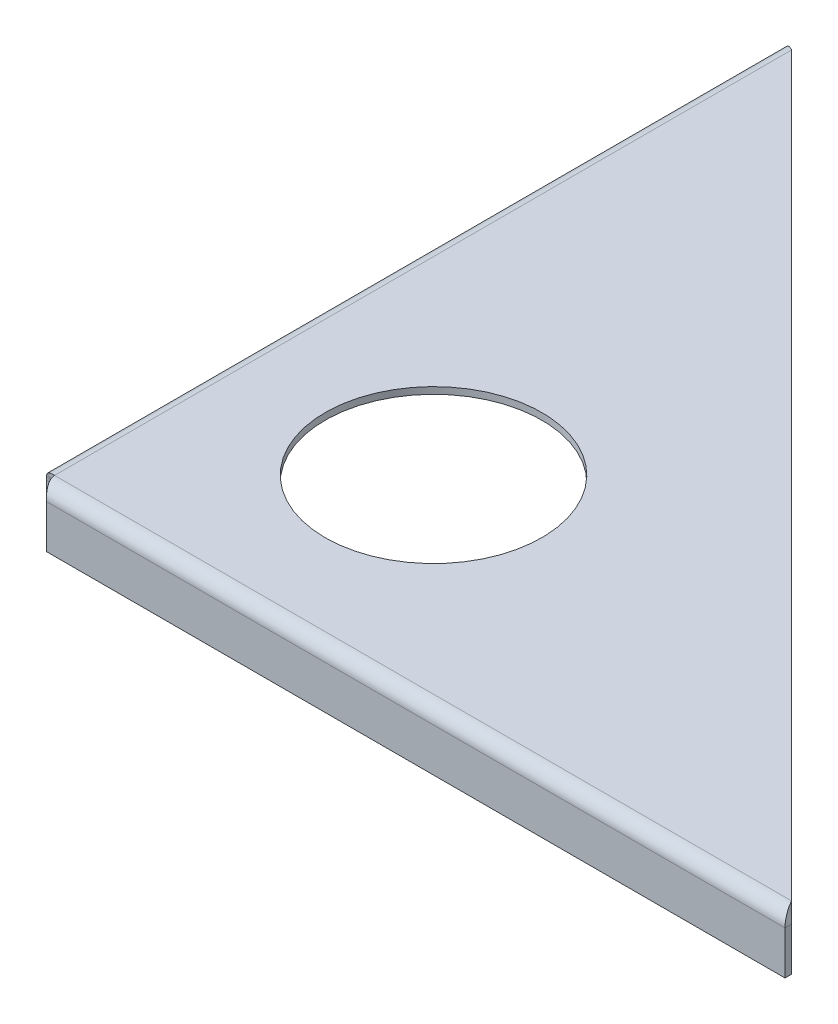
ISO-10303-21;
HEADER;
FILE_DESCRIPTION(('STEP AP214'),'2;1');
FILE_NAME('part.step','',(''),(''),'','','');
FILE_SCHEMA(('AUTOMOTIVE_DESIGN { 1 0 10303 214 1 1 1 1 }'));
ENDSEC;
DATA;
#1=APPLICATION_CONTEXT('core data for automotive mechanical design processes');
#2=APPLICATION_PROTOCOL_DEFINITION('international standard','automotive_design',2000,#1);
#3=PRODUCT_CONTEXT('',#1,'mechanical');
#4=PRODUCT('Part','Part','',(#3));
#5=PRODUCT_RELATED_PRODUCT_CATEGORY('part','',(#4));
#6=PRODUCT_DEFINITION_FORMATION('','',#4);
#7=PRODUCT_DEFINITION_CONTEXT('part definition',#1,'design');
#8=PRODUCT_DEFINITION('design','',#6,#7);
#9=PRODUCT_DEFINITION_SHAPE('','',#8);
#10=(LENGTH_UNIT() NAMED_UNIT(*) SI_UNIT(.MILLI.,.METRE.));
#11=(NAMED_UNIT(*) PLANE_ANGLE_UNIT() SI_UNIT($,.RADIAN.));
#12=(NAMED_UNIT(*) SI_UNIT($,.STERADIAN.) SOLID_ANGLE_UNIT());
#13=UNCERTAINTY_MEASURE_WITH_UNIT(LENGTH_MEASURE(1.E-05),#10,'distance_accuracy_value','');
#14=(GEOMETRIC_REPRESENTATION_CONTEXT(3) GLOBAL_UNCERTAINTY_ASSIGNED_CONTEXT((#13)) GLOBAL_UNIT_ASSIGNED_CONTEXT((#10,
#11,#12)) REPRESENTATION_CONTEXT('',''));
#15=CARTESIAN_POINT('',(0.,0.,0.));
#16=DIRECTION('',(0.,0.,1.));
#17=DIRECTION('',(1.,0.,0.));
#18=AXIS2_PLACEMENT_3D('',#15,#16,#17);
#19=CARTESIAN_POINT('',(1.4142135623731,-0.8,0.8));
#20=CARTESIAN_POINT('',(1.4142135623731,-0.585337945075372,0.8));
#21=CARTESIAN_POINT('',(1.37582521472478,-0.375007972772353,0.756592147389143));
#22=CARTESIAN_POINT('',(1.26066017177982,0.0102260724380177,0.595396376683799));
#23=CARTESIAN_POINT('',(1.18388347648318,0.185084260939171,0.477657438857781));
#24=CARTESIAN_POINT('',(1.03033008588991,0.477657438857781,0.185084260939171));
#25=CARTESIAN_POINT('',(0.953553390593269,0.595396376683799,0.0102260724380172));
#26=CARTESIAN_POINT('',(0.838388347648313,0.756592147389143,-0.375007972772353));
#27=CARTESIAN_POINT('',(0.799999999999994,0.8,-0.585337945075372));
#28=CARTESIAN_POINT('',(0.799999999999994,0.8,-0.8));
#29=CARTESIAN_POINT('',(1.4142135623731,-0.8,0.));
#30=CARTESIAN_POINT('',(1.4142135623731,-0.692668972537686,0.));
#31=CARTESIAN_POINT('',(1.37582521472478,-0.587503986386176,-0.0217039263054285));
#32=CARTESIAN_POINT('',(1.26066017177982,-0.394886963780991,-0.102301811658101));
#33=CARTESIAN_POINT('',(1.18388347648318,-0.307457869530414,-0.16117128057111));
#34=CARTESIAN_POINT('',(1.03033008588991,-0.16117128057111,-0.307457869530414));
#35=CARTESIAN_POINT('',(0.953553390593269,-0.102301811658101,-0.394886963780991));
#36=CARTESIAN_POINT('',(0.838388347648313,-0.0217039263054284,-0.587503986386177));
#37=CARTESIAN_POINT('',(0.799999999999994,0.,-0.692668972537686));
#38=CARTESIAN_POINT('',(0.799999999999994,0.,-0.8));
#39=B_SPLINE_SURFACE_WITH_KNOTS('',1,3,((#19,#20,#21,#22,#23,#24,#25,#26,#27,#28),(#29,#30,#31,
#32,#33,#34,#35,#36,#37,#38)),.UNSPECIFIED.,.F.,.F.,.F.,(2,2),(4,2,2,2,4),(0.,1.),(0.,0.25,0.5,
0.75,1.),.UNSPECIFIED.);
#40=CARTESIAN_POINT('',(0.8,0.,-0.799999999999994));
#41=CARTESIAN_POINT('',(0.8,0.8,-0.799999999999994));
#42=B_SPLINE_CURVE_WITH_KNOTS('',1,(#40,#41),.UNSPECIFIED.,.F.,.F.,(2,2),(0.,1.),.UNSPECIFIED.);
#43=CARTESIAN_POINT('',(0.799999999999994,0.,-0.799999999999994));
#44=VERTEX_POINT('',#43);
#45=CARTESIAN_POINT('',(0.799999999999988,0.8,-0.799999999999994));
#46=VERTEX_POINT('',#45);
#47=EDGE_CURVE('E11',#44,#46,#42,.T.);
#48=CARTESIAN_POINT('',(0.799999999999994,0.,-0.8));
#49=CARTESIAN_POINT('',(0.799999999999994,0.,-0.692668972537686));
#50=CARTESIAN_POINT('',(0.838388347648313,-0.0217039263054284,-0.587503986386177));
#51=CARTESIAN_POINT('',(0.953553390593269,-0.102301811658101,-0.394886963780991));
#52=CARTESIAN_POINT('',(1.03033008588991,-0.16117128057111,-0.307457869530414));
#53=CARTESIAN_POINT('',(1.18388347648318,-0.307457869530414,-0.16117128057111));
#54=CARTESIAN_POINT('',(1.26066017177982,-0.394886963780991,-0.102301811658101));
#55=CARTESIAN_POINT('',(1.37582521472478,-0.587503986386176,-0.0217039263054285));
#56=CARTESIAN_POINT('',(1.4142135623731,-0.692668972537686,0.));
#57=CARTESIAN_POINT('',(1.4142135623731,-0.8,0.));
#58=B_SPLINE_CURVE_WITH_KNOTS('',3,(#48,#49,#50,#51,#52,#53,#54,#55,#56,#57),.UNSPECIFIED.,.F.,
.F.,(4,2,2,2,4),(0.,0.25,0.5,0.75,1.),.UNSPECIFIED.);
#59=CARTESIAN_POINT('',(1.4142135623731,-0.8,0.));
#60=VERTEX_POINT('',#59);
#61=EDGE_CURVE('E147',#44,#60,#58,.T.);
#62=CARTESIAN_POINT('',(1.4142135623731,-0.8,0.));
#63=CARTESIAN_POINT('',(1.4142135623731,-0.8,0.8));
#64=B_SPLINE_CURVE_WITH_KNOTS('',1,(#62,#63),.UNSPECIFIED.,.F.,.F.,(2,2),(0.,1.),.UNSPECIFIED.);
#65=CARTESIAN_POINT('',(1.4142135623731,-0.800000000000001,0.8));
#66=VERTEX_POINT('',#65);
#67=EDGE_CURVE('E51',#60,#66,#64,.T.);
#68=CARTESIAN_POINT('',(1.4142135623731,-0.8,0.8));
#69=CARTESIAN_POINT('',(1.4142135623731,-0.585337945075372,0.8));
#70=CARTESIAN_POINT('',(1.37582521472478,-0.375007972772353,0.756592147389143));
#71=CARTESIAN_POINT('',(1.26066017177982,0.0102260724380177,0.595396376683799));
#72=CARTESIAN_POINT('',(1.18388347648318,0.185084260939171,0.477657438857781));
#73=CARTESIAN_POINT('',(1.03033008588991,0.477657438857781,0.185084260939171));
#74=CARTESIAN_POINT('',(0.953553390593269,0.595396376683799,0.0102260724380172));
#75=CARTESIAN_POINT('',(0.838388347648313,0.756592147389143,-0.375007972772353));
#76=CARTESIAN_POINT('',(0.799999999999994,0.8,-0.585337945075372));
#77=CARTESIAN_POINT('',(0.799999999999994,0.8,-0.8));
#78=B_SPLINE_CURVE_WITH_KNOTS('',3,(#68,#69,#70,#71,#72,#73,#74,#75,#76,#77),.UNSPECIFIED.,.F.,
.F.,(4,2,2,2,4),(0.,0.25,0.5,0.75,1.),.UNSPECIFIED.);
#79=EDGE_CURVE('E288',#46,#66,#78,.F.);
#80=ORIENTED_EDGE('',*,*,#47,.F.);
#81=ORIENTED_EDGE('',*,*,#61,.T.);
#82=ORIENTED_EDGE('',*,*,#67,.T.);
#83=ORIENTED_EDGE('',*,*,#79,.F.);
#84=EDGE_LOOP('',(#80,#81,#82,#83));
#85=FACE_BOUND('',#84,.T.);
#86=ADVANCED_FACE('F38',(#85),#39,.F.);
#87=CARTESIAN_POINT('',(1.4142135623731,-6.,0.));
#88=DIRECTION('',(-1.,0.,0.));
#89=DIRECTION('',(0.,-1.,0.));
#90=AXIS2_PLACEMENT_3D('',#87,#88,#89);
#91=PLANE('',#90);
#92=ORIENTED_EDGE('',*,*,#67,.F.);
#93=DIRECTION('',(0.,-1.,0.));
#94=VECTOR('',#93,1.);
#95=CARTESIAN_POINT('',(1.4142135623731,-6.,0.));
#96=LINE('',#95,#94);
#97=CARTESIAN_POINT('',(1.41421356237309,-6.,0.));
#98=VERTEX_POINT('',#97);
#99=EDGE_CURVE('E137',#60,#98,#96,.T.);
#100=ORIENTED_EDGE('',*,*,#99,.T.);
#101=DIRECTION('',(0.,0.,1.));
#102=VECTOR('',#101,1.);
#103=CARTESIAN_POINT('',(1.41421356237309,-6.,0.));
#104=LINE('',#103,#102);
#105=CARTESIAN_POINT('',(1.41421356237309,-6.,0.8));
#106=VERTEX_POINT('',#105);
#107=EDGE_CURVE('E657',#98,#106,#104,.T.);
#108=ORIENTED_EDGE('',*,*,#107,.T.);
#109=DIRECTION('',(0.,1.,0.));
#110=VECTOR('',#109,1.);
#111=CARTESIAN_POINT('',(1.4142135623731,-6.,0.8));
#112=LINE('',#111,#110);
#113=EDGE_CURVE('E177',#66,#106,#112,.F.);
#114=ORIENTED_EDGE('',*,*,#113,.F.);
#115=EDGE_LOOP('',(#92,#100,#108,#114));
#116=FACE_BOUND('',#115,.T.);
#117=ADVANCED_FACE('F302',(#116),#91,.T.);
#118=CARTESIAN_POINT('',(0.,-6.,0.));
#119=DIRECTION('',(0.,-1.,0.));
#120=DIRECTION('',(1.,0.,0.));
#121=AXIS2_PLACEMENT_3D('',#118,#119,#120);
#122=PLANE('',#121);
#123=ORIENTED_EDGE('',*,*,#107,.F.);
#124=DIRECTION('',(1.,0.,0.));
#125=VECTOR('',#124,1.);
#126=CARTESIAN_POINT('',(0.,-6.,0.));
#127=LINE('',#126,#125);
#128=CARTESIAN_POINT('',(90.,-6.,0.));
#129=VERTEX_POINT('',#128);
#130=EDGE_CURVE('E151',#98,#129,#127,.T.);
#131=ORIENTED_EDGE('',*,*,#130,.T.);
#132=DIRECTION('',(0.,0.,1.));
#133=VECTOR('',#132,1.);
#134=CARTESIAN_POINT('',(90.,-6.,0.));
#135=LINE('',#134,#133);
#136=CARTESIAN_POINT('',(90.,-6.,0.8));
#137=VERTEX_POINT('',#136);
#138=EDGE_CURVE('E126',#129,#137,#135,.T.);
#139=ORIENTED_EDGE('',*,*,#138,.T.);
#140=DIRECTION('',(1.,0.,0.));
#141=VECTOR('',#140,1.);
#142=CARTESIAN_POINT('',(0.,-6.,0.8));
#143=LINE('',#142,#141);
#144=EDGE_CURVE('E392',#106,#137,#143,.T.);
#145=ORIENTED_EDGE('',*,*,#144,.F.);
#146=EDGE_LOOP('',(#123,#131,#139,#145));
#147=FACE_BOUND('',#146,.T.);
#148=ADVANCED_FACE('F521',(#147),#122,.T.);
#149=CARTESIAN_POINT('',(90.,-6.,0.));
#150=DIRECTION('',(1.,0.,0.));
#151=DIRECTION('',(0.,1.,0.));
#152=AXIS2_PLACEMENT_3D('',#149,#150,#151);
#153=PLANE('',#152);
#154=ORIENTED_EDGE('',*,*,#138,.F.);
#155=DIRECTION('',(0.,1.,0.));
#156=VECTOR('',#155,1.);
#157=CARTESIAN_POINT('',(90.,-6.,0.));
#158=LINE('',#157,#156);
#159=CARTESIAN_POINT('',(90.,-0.8,0.));
#160=VERTEX_POINT('',#159);
#161=EDGE_CURVE('E135',#129,#160,#158,.T.);
#162=ORIENTED_EDGE('',*,*,#161,.T.);
#163=DIRECTION('',(0.,0.,1.));
#164=VECTOR('',#163,1.);
#165=CARTESIAN_POINT('',(90.,-0.8,0.));
#166=LINE('',#165,#164);
#167=CARTESIAN_POINT('',(90.,-0.8,0.8));
#168=VERTEX_POINT('',#167);
#169=EDGE_CURVE('E59',#160,#168,#166,.T.);
#170=ORIENTED_EDGE('',*,*,#169,.T.);
#171=DIRECTION('',(0.,1.,0.));
#172=VECTOR('',#171,1.);
#173=CARTESIAN_POINT('',(90.,-6.,0.8));
#174=LINE('',#173,#172);
#175=EDGE_CURVE('E395',#137,#168,#174,.T.);
#176=ORIENTED_EDGE('',*,*,#175,.F.);
#177=EDGE_LOOP('',(#154,#162,#170,#176));
#178=FACE_BOUND('',#177,.T.);
#179=ADVANCED_FACE('F149',(#178),#153,.T.);
#180=CARTESIAN_POINT('',(90.,-0.8,0.8));
#181=CARTESIAN_POINT('',(90.,-0.8,0.533333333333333));
#182=CARTESIAN_POINT('',(90.,-0.8,0.266666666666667));
#183=CARTESIAN_POINT('',(90.,-0.8,0.));
#184=CARTESIAN_POINT('',(90.,2.4,0.8));
#185=CARTESIAN_POINT('',(90.,1.86666666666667,0.533333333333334));
#186=CARTESIAN_POINT('',(90.,1.33333333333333,0.266666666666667));
#187=CARTESIAN_POINT('',(90.,0.8,0.));
#188=CARTESIAN_POINT('',(88.4,2.4,-2.4));
#189=CARTESIAN_POINT('',(88.4,1.86666666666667,-2.13333333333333));
#190=CARTESIAN_POINT('',(88.4,1.33333333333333,-1.86666666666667));
#191=CARTESIAN_POINT('',(88.4,0.8,-1.6));
#192=CARTESIAN_POINT('',(88.4,-0.8,-2.4));
#193=CARTESIAN_POINT('',(88.4,-0.8,-2.13333333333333));
#194=CARTESIAN_POINT('',(88.4,-0.8,-1.86666666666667));
#195=CARTESIAN_POINT('',(88.4,-0.8,-1.6));
#196=CARTESIAN_POINT('',(88.4,-4.,-2.4));
#197=CARTESIAN_POINT('',(88.4,-3.46666666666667,-2.13333333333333));
#198=CARTESIAN_POINT('',(88.4,-2.93333333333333,-1.86666666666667));
#199=CARTESIAN_POINT('',(88.4,-2.4,-1.6));
#200=CARTESIAN_POINT('',(90.,-4.,0.8));
#201=CARTESIAN_POINT('',(90.,-3.46666666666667,0.533333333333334));
#202=CARTESIAN_POINT('',(90.,-2.93333333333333,0.266666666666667));
#203=CARTESIAN_POINT('',(90.,-2.4,0.));
#204=CARTESIAN_POINT('',(90.,-0.8,0.8));
#205=CARTESIAN_POINT('',(90.,-0.8,0.533333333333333));
#206=CARTESIAN_POINT('',(90.,-0.8,0.266666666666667));
#207=CARTESIAN_POINT('',(90.,-0.8,0.));
#208=(BOUNDED_SURFACE() B_SPLINE_SURFACE(3,3,((#180,#181,#182,#183),(#184,#185,#186,#187),(#188,
#189,#190,#191),(#192,#193,#194,#195),(#196,#197,#198,#199),(#200,#201,#202,#203),(#204,#205,
#206,#207)),.UNSPECIFIED.,.T.,.F.,.F.) B_SPLINE_SURFACE_WITH_KNOTS((4,3,4),(4,4),(0.,0.5,1.),
(0.,1.),.UNSPECIFIED.) GEOMETRIC_REPRESENTATION_ITEM() RATIONAL_B_SPLINE_SURFACE(((1.,1.,1.,1.),
(0.333333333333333,0.333333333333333,0.333333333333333,0.333333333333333),(0.333333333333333,
0.333333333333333,0.333333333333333,0.333333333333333),(1.,1.,1.,1.),(0.333333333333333,
0.333333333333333,0.333333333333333,0.333333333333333),(0.333333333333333,0.333333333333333,
0.333333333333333,0.333333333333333),(1.,1.,1.,1.))) REPRESENTATION_ITEM('') SURFACE());
#209=CARTESIAN_POINT('',(89.2,-0.8,-0.8));
#210=DIRECTION('',(0.707106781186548,0.,-0.707106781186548));
#211=DIRECTION('',(0.707106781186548,0.,0.707106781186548));
#212=AXIS2_PLACEMENT_3D('',#209,#210,#211);
#213=ELLIPSE('',#212,1.13137084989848,0.8);
#214=CARTESIAN_POINT('',(89.2,0.,-0.799999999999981));
#215=VERTEX_POINT('',#214);
#216=EDGE_CURVE('E122',#160,#215,#213,.F.);
#217=DIRECTION('',(0.,1.,0.));
#218=VECTOR('',#217,1.);
#219=CARTESIAN_POINT('',(89.2,0.,-0.799999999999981));
#220=LINE('',#219,#218);
#221=CARTESIAN_POINT('',(89.2,0.8,-0.799999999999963));
#222=VERTEX_POINT('',#221);
#223=EDGE_CURVE('E127',#215,#222,#220,.T.);
#224=CARTESIAN_POINT('',(89.2,-0.8,-0.8));
#225=DIRECTION('',(0.894427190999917,0.,-0.447213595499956));
#226=DIRECTION('',(0.447213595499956,0.,0.894427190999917));
#227=AXIS2_PLACEMENT_3D('',#224,#225,#226);
#228=ELLIPSE('',#227,1.78885438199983,1.6);
#229=EDGE_CURVE('E124',#168,#222,#228,.F.);
#230=ORIENTED_EDGE('',*,*,#169,.F.);
#231=ORIENTED_EDGE('',*,*,#216,.T.);
#232=ORIENTED_EDGE('',*,*,#223,.T.);
#233=ORIENTED_EDGE('',*,*,#229,.F.);
#234=EDGE_LOOP('',(#230,#231,#232,#233));
#235=FACE_BOUND('',#234,.T.);
#236=ADVANCED_FACE('F119',(#235),#208,.F.);
#237=CARTESIAN_POINT('',(0.,0.,-90.));
#238=DIRECTION('',(0.707106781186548,0.,-0.707106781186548));
#239=DIRECTION('',(-0.707106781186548,0.,-0.707106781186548));
#240=AXIS2_PLACEMENT_3D('',#237,#238,#239);
#241=PLANE('',#240);
#242=ORIENTED_EDGE('',*,*,#223,.F.);
#243=DIRECTION('',(-0.707106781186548,0.,-0.707106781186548));
#244=VECTOR('',#243,1.);
#245=CARTESIAN_POINT('',(0.,0.,-90.));
#246=LINE('',#245,#244);
#247=CARTESIAN_POINT('',(0.799999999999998,0.,-89.2));
#248=VERTEX_POINT('',#247);
#249=EDGE_CURVE('E156',#215,#248,#246,.T.);
#250=ORIENTED_EDGE('',*,*,#249,.T.);
#251=DIRECTION('',(0.,1.,0.));
#252=VECTOR('',#251,1.);
#253=CARTESIAN_POINT('',(0.799999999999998,0.,-89.2));
#254=LINE('',#253,#252);
#255=CARTESIAN_POINT('',(0.799999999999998,0.8,-89.2));
#256=VERTEX_POINT('',#255);
#257=EDGE_CURVE('E388',#248,#256,#254,.T.);
#258=ORIENTED_EDGE('',*,*,#257,.T.);
#259=DIRECTION('',(-0.707106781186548,0.,-0.707106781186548));
#260=VECTOR('',#259,1.);
#261=CARTESIAN_POINT('',(0.,0.8,-90.));
#262=LINE('',#261,#260);
#263=EDGE_CURVE('E396',#222,#256,#262,.T.);
#264=ORIENTED_EDGE('',*,*,#263,.F.);
#265=EDGE_LOOP('',(#242,#250,#258,#264));
#266=FACE_BOUND('',#265,.T.);
#267=ADVANCED_FACE('F386',(#266),#241,.T.);
#268=CARTESIAN_POINT('',(1.6,-0.8,-88.4));
#269=CARTESIAN_POINT('',(1.86666666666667,-0.8,-88.4));
#270=CARTESIAN_POINT('',(2.13333333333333,-0.8,-88.4));
#271=CARTESIAN_POINT('',(2.4,-0.8,-88.4));
#272=CARTESIAN_POINT('',(1.6,0.8,-88.4));
#273=CARTESIAN_POINT('',(1.86666666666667,1.33333333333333,-88.4));
#274=CARTESIAN_POINT('',(2.13333333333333,1.86666666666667,-88.4));
#275=CARTESIAN_POINT('',(2.4,2.4,-88.4));
#276=CARTESIAN_POINT('',(0.,0.8,-90.));
#277=CARTESIAN_POINT('',(-0.266666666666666,1.33333333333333,-90.));
#278=CARTESIAN_POINT('',(-0.533333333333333,1.86666666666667,-90.));
#279=CARTESIAN_POINT('',(-0.8,2.4,-90.));
#280=CARTESIAN_POINT('',(0.,-0.8,-90.));
#281=CARTESIAN_POINT('',(-0.266666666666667,-0.8,-90.));
#282=CARTESIAN_POINT('',(-0.533333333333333,-0.8,-90.));
#283=CARTESIAN_POINT('',(-0.8,-0.8,-90.));
#284=CARTESIAN_POINT('',(0.,-2.4,-90.));
#285=CARTESIAN_POINT('',(-0.266666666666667,-2.93333333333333,-90.));
#286=CARTESIAN_POINT('',(-0.533333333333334,-3.46666666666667,-90.));
#287=CARTESIAN_POINT('',(-0.8,-4.,-90.));
#288=CARTESIAN_POINT('',(1.6,-2.4,-88.4));
#289=CARTESIAN_POINT('',(1.86666666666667,-2.93333333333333,-88.4));
#290=CARTESIAN_POINT('',(2.13333333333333,-3.46666666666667,-88.4));
#291=CARTESIAN_POINT('',(2.4,-4.,-88.4));
#292=CARTESIAN_POINT('',(1.6,-0.8,-88.4));
#293=CARTESIAN_POINT('',(1.86666666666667,-0.8,-88.4));
#294=CARTESIAN_POINT('',(2.13333333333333,-0.8,-88.4));
#295=CARTESIAN_POINT('',(2.4,-0.8,-88.4));
#296=(BOUNDED_SURFACE() B_SPLINE_SURFACE(3,3,((#268,#269,#270,#271),(#272,#273,#274,#275),(#276,
#277,#278,#279),(#280,#281,#282,#283),(#284,#285,#286,#287),(#288,#289,#290,#291),(#292,#293,
#294,#295)),.UNSPECIFIED.,.T.,.F.,.F.) B_SPLINE_SURFACE_WITH_KNOTS((4,3,4),(4,4),(0.,0.5,1.),
(0.,1.),.UNSPECIFIED.) GEOMETRIC_REPRESENTATION_ITEM() RATIONAL_B_SPLINE_SURFACE(((1.,1.,1.,1.),
(0.333333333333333,0.333333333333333,0.333333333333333,0.333333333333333),(0.333333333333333,
0.333333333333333,0.333333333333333,0.333333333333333),(1.,1.,1.,1.),(0.333333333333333,
0.333333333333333,0.333333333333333,0.333333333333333),(0.333333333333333,0.333333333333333,
0.333333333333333,0.333333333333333),(1.,1.,1.,1.))) REPRESENTATION_ITEM('') SURFACE());
#297=CARTESIAN_POINT('',(0.8,-0.8,-89.2));
#298=DIRECTION('',(-0.707106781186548,0.,0.707106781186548));
#299=DIRECTION('',(0.707106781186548,0.,0.707106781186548));
#300=AXIS2_PLACEMENT_3D('',#297,#298,#299);
#301=ELLIPSE('',#300,1.13137084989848,0.8);
#302=CARTESIAN_POINT('',(0.,-0.8,-90.));
#303=VERTEX_POINT('',#302);
#304=EDGE_CURVE('E163',#248,#303,#301,.T.);
#305=DIRECTION('',(-1.,0.,0.));
#306=VECTOR('',#305,1.);
#307=CARTESIAN_POINT('',(0.,-0.8,-90.));
#308=LINE('',#307,#306);
#309=CARTESIAN_POINT('',(-0.8,-0.800000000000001,-90.));
#310=VERTEX_POINT('',#309);
#311=EDGE_CURVE('E663',#303,#310,#308,.T.);
#312=CARTESIAN_POINT('',(0.8,-0.8,-89.2));
#313=DIRECTION('',(-0.447213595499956,0.,0.894427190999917));
#314=DIRECTION('',(0.894427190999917,0.,0.447213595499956));
#315=AXIS2_PLACEMENT_3D('',#312,#313,#314);
#316=ELLIPSE('',#315,1.78885438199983,1.6);
#317=EDGE_CURVE('E401',#256,#310,#316,.T.);
#318=ORIENTED_EDGE('',*,*,#257,.F.);
#319=ORIENTED_EDGE('',*,*,#304,.T.);
#320=ORIENTED_EDGE('',*,*,#311,.T.);
#321=ORIENTED_EDGE('',*,*,#317,.F.);
#322=EDGE_LOOP('',(#318,#319,#320,#321));
#323=FACE_BOUND('',#322,.T.);
#324=ADVANCED_FACE('F495',(#323),#296,.T.);
#325=CARTESIAN_POINT('',(0.,-6.,-90.));
#326=DIRECTION('',(0.,0.,1.));
#327=DIRECTION('',(0.,1.,0.));
#328=AXIS2_PLACEMENT_3D('',#325,#326,#327);
#329=PLANE('',#328);
#330=ORIENTED_EDGE('',*,*,#311,.F.);
#331=DIRECTION('',(0.,1.,0.));
#332=VECTOR('',#331,1.);
#333=CARTESIAN_POINT('',(0.,-6.,-90.));
#334=LINE('',#333,#332);
#335=CARTESIAN_POINT('',(0.,-6.,-90.));
#336=VERTEX_POINT('',#335);
#337=EDGE_CURVE('E150',#336,#303,#334,.T.);
#338=ORIENTED_EDGE('',*,*,#337,.F.);
#339=DIRECTION('',(-1.,0.,0.));
#340=VECTOR('',#339,1.);
#341=CARTESIAN_POINT('',(0.,-6.,-90.));
#342=LINE('',#341,#340);
#343=CARTESIAN_POINT('',(-0.8,-6.,-90.));
#344=VERTEX_POINT('',#343);
#345=EDGE_CURVE('E665',#336,#344,#342,.T.);
#346=ORIENTED_EDGE('',*,*,#345,.T.);
#347=DIRECTION('',(0.,1.,0.));
#348=VECTOR('',#347,1.);
#349=CARTESIAN_POINT('',(-0.8,-6.,-90.));
#350=LINE('',#349,#348);
#351=EDGE_CURVE('E398',#344,#310,#350,.T.);
#352=ORIENTED_EDGE('',*,*,#351,.T.);
#353=EDGE_LOOP('',(#330,#338,#346,#352));
#354=FACE_BOUND('',#353,.T.);
#355=ADVANCED_FACE('F488',(#354),#329,.F.);
#356=CARTESIAN_POINT('',(0.,-6.,0.));
#357=DIRECTION('',(0.,-1.,0.));
#358=DIRECTION('',(0.,0.,1.));
#359=AXIS2_PLACEMENT_3D('',#356,#357,#358);
#360=PLANE('',#359);
#361=ORIENTED_EDGE('',*,*,#345,.F.);
#362=DIRECTION('',(0.,0.,1.));
#363=VECTOR('',#362,1.);
#364=CARTESIAN_POINT('',(0.,-6.,0.));
#365=LINE('',#364,#363);
#366=CARTESIAN_POINT('',(0.,-6.,-1.41421356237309));
#367=VERTEX_POINT('',#366);
#368=EDGE_CURVE('E154',#336,#367,#365,.T.);
#369=ORIENTED_EDGE('',*,*,#368,.T.);
#370=DIRECTION('',(-1.,0.,0.));
#371=VECTOR('',#370,1.);
#372=CARTESIAN_POINT('',(0.,-6.,-1.41421356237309));
#373=LINE('',#372,#371);
#374=CARTESIAN_POINT('',(-0.8,-6.,-1.41421356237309));
#375=VERTEX_POINT('',#374);
#376=EDGE_CURVE('E373',#367,#375,#373,.T.);
#377=ORIENTED_EDGE('',*,*,#376,.T.);
#378=DIRECTION('',(0.,0.,1.));
#379=VECTOR('',#378,1.);
#380=CARTESIAN_POINT('',(-0.8,-6.,0.));
#381=LINE('',#380,#379);
#382=EDGE_CURVE('E229',#344,#375,#381,.T.);
#383=ORIENTED_EDGE('',*,*,#382,.F.);
#384=EDGE_LOOP('',(#361,#369,#377,#383));
#385=FACE_BOUND('',#384,.T.);
#386=ADVANCED_FACE('F482',(#385),#360,.T.);
#387=CARTESIAN_POINT('',(0.,-6.,-1.4142135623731));
#388=DIRECTION('',(0.,0.,1.));
#389=DIRECTION('',(0.,1.,0.));
#390=AXIS2_PLACEMENT_3D('',#387,#388,#389);
#391=PLANE('',#390);
#392=ORIENTED_EDGE('',*,*,#376,.F.);
#393=DIRECTION('',(0.,1.,0.));
#394=VECTOR('',#393,1.);
#395=CARTESIAN_POINT('',(0.,-6.,-1.4142135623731));
#396=LINE('',#395,#394);
#397=CARTESIAN_POINT('',(0.,-0.8,-1.4142135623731));
#398=VERTEX_POINT('',#397);
#399=EDGE_CURVE('E162',#367,#398,#396,.T.);
#400=ORIENTED_EDGE('',*,*,#399,.T.);
#401=CARTESIAN_POINT('',(-0.8,-0.8,-1.4142135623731));
#402=CARTESIAN_POINT('',(0.,-0.8,-1.4142135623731));
#403=B_SPLINE_CURVE_WITH_KNOTS('',1,(#401,#402),.UNSPECIFIED.,.F.,.F.,(2,2),(0.,1.),.UNSPECIFIED.);
#404=CARTESIAN_POINT('',(-0.8,-0.8,-1.4142135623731));
#405=VERTEX_POINT('',#404);
#406=EDGE_CURVE('E354',#398,#405,#403,.F.);
#407=ORIENTED_EDGE('',*,*,#406,.T.);
#408=DIRECTION('',(0.,1.,0.));
#409=VECTOR('',#408,1.);
#410=CARTESIAN_POINT('',(-0.8,-6.,-1.41421356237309));
#411=LINE('',#410,#409);
#412=EDGE_CURVE('E226',#375,#405,#411,.T.);
#413=ORIENTED_EDGE('',*,*,#412,.F.);
#414=EDGE_LOOP('',(#392,#400,#407,#413));
#415=FACE_BOUND('',#414,.T.);
#416=ADVANCED_FACE('F266',(#415),#391,.T.);
#417=CARTESIAN_POINT('',(0.8,0.8,-0.799999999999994));
#418=CARTESIAN_POINT('',(0.585337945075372,0.8,-0.799999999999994));
#419=CARTESIAN_POINT('',(0.375007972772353,0.756592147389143,-0.838388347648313));
#420=CARTESIAN_POINT('',(-0.0102260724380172,0.595396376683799,-0.953553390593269));
#421=CARTESIAN_POINT('',(-0.185084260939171,0.477657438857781,-1.03033008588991));
#422=CARTESIAN_POINT('',(-0.477657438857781,0.185084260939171,-1.18388347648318));
#423=CARTESIAN_POINT('',(-0.595396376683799,0.0102260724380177,-1.26066017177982));
#424=CARTESIAN_POINT('',(-0.756592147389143,-0.375007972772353,-1.37582521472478));
#425=CARTESIAN_POINT('',(-0.8,-0.585337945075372,-1.4142135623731));
#426=CARTESIAN_POINT('',(-0.8,-0.8,-1.4142135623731));
#427=CARTESIAN_POINT('',(0.8,0.,-0.799999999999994));
#428=CARTESIAN_POINT('',(0.692668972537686,0.,-0.799999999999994));
#429=CARTESIAN_POINT('',(0.587503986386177,-0.0217039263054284,-0.838388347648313));
#430=CARTESIAN_POINT('',(0.394886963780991,-0.102301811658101,-0.953553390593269));
#431=CARTESIAN_POINT('',(0.307457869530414,-0.16117128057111,-1.03033008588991));
#432=CARTESIAN_POINT('',(0.16117128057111,-0.307457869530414,-1.18388347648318));
#433=CARTESIAN_POINT('',(0.102301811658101,-0.394886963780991,-1.26066017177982));
#434=CARTESIAN_POINT('',(0.0217039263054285,-0.587503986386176,-1.37582521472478));
#435=CARTESIAN_POINT('',(0.,-0.692668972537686,-1.4142135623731));
#436=CARTESIAN_POINT('',(0.,-0.8,-1.4142135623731));
#437=B_SPLINE_SURFACE_WITH_KNOTS('',1,3,((#417,#418,#419,#420,#421,#422,#423,#424,#425,#426),
(#427,#428,#429,#430,#431,#432,#433,#434,#435,#436)),.UNSPECIFIED.,.F.,.F.,.F.,(2,2),(4,2,2,2,
4),(0.,1.),(0.,0.25,0.5,0.75,1.),.UNSPECIFIED.);
#438=CARTESIAN_POINT('',(0.,-0.8,-1.4142135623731));
#439=CARTESIAN_POINT('',(0.,-0.692668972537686,-1.4142135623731));
#440=CARTESIAN_POINT('',(0.0217039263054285,-0.587503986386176,-1.37582521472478));
#441=CARTESIAN_POINT('',(0.102301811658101,-0.394886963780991,-1.26066017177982));
#442=CARTESIAN_POINT('',(0.16117128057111,-0.307457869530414,-1.18388347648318));
#443=CARTESIAN_POINT('',(0.307457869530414,-0.16117128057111,-1.03033008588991));
#444=CARTESIAN_POINT('',(0.394886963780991,-0.102301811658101,-0.953553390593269));
#445=CARTESIAN_POINT('',(0.587503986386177,-0.0217039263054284,-0.838388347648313));
#446=CARTESIAN_POINT('',(0.692668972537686,0.,-0.799999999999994));
#447=CARTESIAN_POINT('',(0.8,0.,-0.799999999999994));
#448=B_SPLINE_CURVE_WITH_KNOTS('',3,(#438,#439,#440,#441,#442,#443,#444,#445,#446,#447),
.UNSPECIFIED.,.F.,.F.,(4,2,2,2,4),(0.,0.25,0.5,0.75,1.),.UNSPECIFIED.);
#449=EDGE_CURVE('E165',#398,#44,#448,.T.);
#450=CARTESIAN_POINT('',(0.8,0.8,-0.799999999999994));
#451=CARTESIAN_POINT('',(0.585337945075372,0.8,-0.799999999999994));
#452=CARTESIAN_POINT('',(0.375007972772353,0.756592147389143,-0.838388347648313));
#453=CARTESIAN_POINT('',(-0.0102260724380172,0.595396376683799,-0.953553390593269));
#454=CARTESIAN_POINT('',(-0.185084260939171,0.477657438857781,-1.03033008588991));
#455=CARTESIAN_POINT('',(-0.477657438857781,0.185084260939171,-1.18388347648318));
#456=CARTESIAN_POINT('',(-0.595396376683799,0.0102260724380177,-1.26066017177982));
#457=CARTESIAN_POINT('',(-0.756592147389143,-0.375007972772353,-1.37582521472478));
#458=CARTESIAN_POINT('',(-0.8,-0.585337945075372,-1.4142135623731));
#459=CARTESIAN_POINT('',(-0.8,-0.8,-1.4142135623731));
#460=B_SPLINE_CURVE_WITH_KNOTS('',3,(#450,#451,#452,#453,#454,#455,#456,#457,#458,#459),
.UNSPECIFIED.,.F.,.F.,(4,2,2,2,4),(0.,0.25,0.5,0.75,1.),.UNSPECIFIED.);
#461=EDGE_CURVE('E221',#405,#46,#460,.F.);
#462=ORIENTED_EDGE('',*,*,#449,.T.);
#463=ORIENTED_EDGE('',*,*,#47,.T.);
#464=ORIENTED_EDGE('',*,*,#461,.F.);
#465=ORIENTED_EDGE('',*,*,#406,.F.);
#466=EDGE_LOOP('',(#462,#463,#464,#465));
#467=FACE_BOUND('',#466,.T.);
#468=ADVANCED_FACE('F40',(#467),#437,.F.);
#469=CARTESIAN_POINT('',(-0.8,-6.,0.));
#470=DIRECTION('',(-1.,0.,0.));
#471=DIRECTION('',(0.,0.,1.));
#472=AXIS2_PLACEMENT_3D('',#469,#470,#471);
#473=PLANE('',#472);
#474=ORIENTED_EDGE('',*,*,#412,.T.);
#475=DIRECTION('',(0.,0.,1.));
#476=VECTOR('',#475,1.);
#477=CARTESIAN_POINT('',(-0.8,-0.8,0.));
#478=LINE('',#477,#476);
#479=EDGE_CURVE('E232',#405,#310,#478,.F.);
#480=ORIENTED_EDGE('',*,*,#479,.T.);
#481=ORIENTED_EDGE('',*,*,#351,.F.);
#482=ORIENTED_EDGE('',*,*,#382,.T.);
#483=EDGE_LOOP('',(#474,#480,#481,#482));
#484=FACE_BOUND('',#483,.T.);
#485=ADVANCED_FACE('F199',(#484),#473,.T.);
#486=CARTESIAN_POINT('',(0.,-6.,0.8));
#487=DIRECTION('',(0.,0.,1.));
#488=DIRECTION('',(1.,0.,0.));
#489=AXIS2_PLACEMENT_3D('',#486,#487,#488);
#490=PLANE('',#489);
#491=ORIENTED_EDGE('',*,*,#175,.T.);
#492=DIRECTION('',(1.,0.,0.));
#493=VECTOR('',#492,1.);
#494=CARTESIAN_POINT('',(0.,-0.8,0.8));
#495=LINE('',#494,#493);
#496=EDGE_CURVE('E374',#168,#66,#495,.F.);
#497=ORIENTED_EDGE('',*,*,#496,.T.);
#498=ORIENTED_EDGE('',*,*,#113,.T.);
#499=ORIENTED_EDGE('',*,*,#144,.T.);
#500=EDGE_LOOP('',(#491,#497,#498,#499));
#501=FACE_BOUND('',#500,.T.);
#502=ADVANCED_FACE('F458',(#501),#490,.T.);
#503=CARTESIAN_POINT('',(0.,0.8,0.));
#504=DIRECTION('',(0.,1.,0.));
#505=DIRECTION('',(0.,0.,1.));
#506=AXIS2_PLACEMENT_3D('',#503,#504,#505);
#507=PLANE('',#506);
#508=CARTESIAN_POINT('',(23.4900227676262,0.8,-23.5578085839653));
#509=DIRECTION('',(0.,1.,0.));
#510=DIRECTION('',(0.,0.,1.));
#511=AXIS2_PLACEMENT_3D('',#508,#509,#510);
#512=CIRCLE('',#511,13.);
#513=CARTESIAN_POINT('',(23.4900227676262,0.8,-10.5578085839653));
#514=VERTEX_POINT('',#513);
#515=EDGE_CURVE('E408',#514,#514,#512,.T.);
#516=ORIENTED_EDGE('',*,*,#515,.F.);
#517=EDGE_LOOP('',(#516));
#518=FACE_BOUND('',#517,.T.);
#519=DIRECTION('',(0.,0.,1.));
#520=VECTOR('',#519,1.);
#521=CARTESIAN_POINT('',(0.799999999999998,0.8,0.));
#522=LINE('',#521,#520);
#523=EDGE_CURVE('E207',#256,#46,#522,.T.);
#524=ORIENTED_EDGE('',*,*,#523,.T.);
#525=DIRECTION('',(1.,0.,0.));
#526=VECTOR('',#525,1.);
#527=CARTESIAN_POINT('',(0.,0.8,-0.799999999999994));
#528=LINE('',#527,#526);
#529=EDGE_CURVE('E235',#46,#222,#528,.T.);
#530=ORIENTED_EDGE('',*,*,#529,.T.);
#531=ORIENTED_EDGE('',*,*,#263,.T.);
#532=EDGE_LOOP('',(#524,#530,#531));
#533=FACE_BOUND('',#532,.T.);
#534=ADVANCED_FACE('F197',(#518,#533),#507,.T.);
#535=CARTESIAN_POINT('',(0.8,-0.8,0.));
#536=DIRECTION('',(0.,0.,1.));
#537=DIRECTION('',(1.,0.,0.));
#538=AXIS2_PLACEMENT_3D('',#535,#536,#537);
#539=CYLINDRICAL_SURFACE('',#538,1.6);
#540=ORIENTED_EDGE('',*,*,#317,.T.);
#541=ORIENTED_EDGE('',*,*,#479,.F.);
#542=ORIENTED_EDGE('',*,*,#461,.T.);
#543=ORIENTED_EDGE('',*,*,#523,.F.);
#544=EDGE_LOOP('',(#540,#541,#542,#543));
#545=FACE_BOUND('',#544,.T.);
#546=ADVANCED_FACE('F191',(#545),#539,.T.);
#547=CARTESIAN_POINT('',(0.,-0.8,-0.8));
#548=DIRECTION('',(1.,0.,0.));
#549=DIRECTION('',(0.,0.,-1.));
#550=AXIS2_PLACEMENT_3D('',#547,#548,#549);
#551=CYLINDRICAL_SURFACE('',#550,1.6);
#552=ORIENTED_EDGE('',*,*,#79,.T.);
#553=ORIENTED_EDGE('',*,*,#496,.F.);
#554=ORIENTED_EDGE('',*,*,#229,.T.);
#555=ORIENTED_EDGE('',*,*,#529,.F.);
#556=EDGE_LOOP('',(#552,#553,#554,#555));
#557=FACE_BOUND('',#556,.T.);
#558=ADVANCED_FACE('F180',(#557),#551,.T.);
#559=CARTESIAN_POINT('',(0.,-6.,0.));
#560=DIRECTION('',(-1.,0.,0.));
#561=DIRECTION('',(0.,0.,1.));
#562=AXIS2_PLACEMENT_3D('',#559,#560,#561);
#563=PLANE('',#562);
#564=ORIENTED_EDGE('',*,*,#399,.F.);
#565=ORIENTED_EDGE('',*,*,#368,.F.);
#566=ORIENTED_EDGE('',*,*,#337,.T.);
#567=DIRECTION('',(0.,0.,1.));
#568=VECTOR('',#567,1.);
#569=CARTESIAN_POINT('',(0.,-0.8,0.));
#570=LINE('',#569,#568);
#571=EDGE_CURVE('E249',#398,#303,#570,.F.);
#572=ORIENTED_EDGE('',*,*,#571,.F.);
#573=EDGE_LOOP('',(#564,#565,#566,#572));
#574=FACE_BOUND('',#573,.T.);
#575=ADVANCED_FACE('F190',(#574),#563,.F.);
#576=CARTESIAN_POINT('',(0.,-6.,0.));
#577=DIRECTION('',(0.,0.,1.));
#578=DIRECTION('',(1.,0.,0.));
#579=AXIS2_PLACEMENT_3D('',#576,#577,#578);
#580=PLANE('',#579);
#581=ORIENTED_EDGE('',*,*,#161,.F.);
#582=ORIENTED_EDGE('',*,*,#130,.F.);
#583=ORIENTED_EDGE('',*,*,#99,.F.);
#584=DIRECTION('',(1.,0.,0.));
#585=VECTOR('',#584,1.);
#586=CARTESIAN_POINT('',(0.,-0.8,0.));
#587=LINE('',#586,#585);
#588=EDGE_CURVE('E132',#160,#60,#587,.F.);
#589=ORIENTED_EDGE('',*,*,#588,.F.);
#590=EDGE_LOOP('',(#581,#582,#583,#589));
#591=FACE_BOUND('',#590,.T.);
#592=ADVANCED_FACE('F133',(#591),#580,.F.);
#593=CARTESIAN_POINT('',(0.,0.,0.));
#594=DIRECTION('',(0.,1.,0.));
#595=DIRECTION('',(0.,0.,1.));
#596=AXIS2_PLACEMENT_3D('',#593,#594,#595);
#597=PLANE('',#596);
#598=CARTESIAN_POINT('',(23.4900227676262,0.,-23.5578085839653));
#599=DIRECTION('',(0.,1.,0.));
#600=DIRECTION('',(0.,0.,1.));
#601=AXIS2_PLACEMENT_3D('',#598,#599,#600);
#602=CIRCLE('',#601,13.);
#603=CARTESIAN_POINT('',(23.4900227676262,0.,-10.5578085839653));
#604=VERTEX_POINT('',#603);
#605=EDGE_CURVE('E45',#604,#604,#602,.T.);
#606=ORIENTED_EDGE('',*,*,#605,.T.);
#607=EDGE_LOOP('',(#606));
#608=FACE_BOUND('',#607,.T.);
#609=DIRECTION('',(0.,0.,1.));
#610=VECTOR('',#609,1.);
#611=CARTESIAN_POINT('',(0.8,0.,0.));
#612=LINE('',#611,#610);
#613=EDGE_CURVE('E170',#248,#44,#612,.T.);
#614=ORIENTED_EDGE('',*,*,#613,.F.);
#615=ORIENTED_EDGE('',*,*,#249,.F.);
#616=DIRECTION('',(1.,0.,0.));
#617=VECTOR('',#616,1.);
#618=CARTESIAN_POINT('',(0.,0.,-0.8));
#619=LINE('',#618,#617);
#620=EDGE_CURVE('E141',#44,#215,#619,.T.);
#621=ORIENTED_EDGE('',*,*,#620,.F.);
#622=EDGE_LOOP('',(#614,#615,#621));
#623=FACE_BOUND('',#622,.T.);
#624=ADVANCED_FACE('F261',(#608,#623),#597,.F.);
#625=CARTESIAN_POINT('',(0.8,-0.8,0.));
#626=DIRECTION('',(0.,0.,1.));
#627=DIRECTION('',(1.,0.,0.));
#628=AXIS2_PLACEMENT_3D('',#625,#626,#627);
#629=CYLINDRICAL_SURFACE('',#628,0.8);
#630=ORIENTED_EDGE('',*,*,#304,.F.);
#631=ORIENTED_EDGE('',*,*,#613,.T.);
#632=ORIENTED_EDGE('',*,*,#449,.F.);
#633=ORIENTED_EDGE('',*,*,#571,.T.);
#634=EDGE_LOOP('',(#630,#631,#632,#633));
#635=FACE_BOUND('',#634,.T.);
#636=ADVANCED_FACE('F251',(#635),#629,.F.);
#637=CARTESIAN_POINT('',(0.,-0.8,-0.8));
#638=DIRECTION('',(1.,0.,0.));
#639=DIRECTION('',(0.,0.,-1.));
#640=AXIS2_PLACEMENT_3D('',#637,#638,#639);
#641=CYLINDRICAL_SURFACE('',#640,0.8);
#642=ORIENTED_EDGE('',*,*,#61,.F.);
#643=ORIENTED_EDGE('',*,*,#620,.T.);
#644=ORIENTED_EDGE('',*,*,#216,.F.);
#645=ORIENTED_EDGE('',*,*,#588,.T.);
#646=EDGE_LOOP('',(#642,#643,#644,#645));
#647=FACE_BOUND('',#646,.T.);
#648=ADVANCED_FACE('F144',(#647),#641,.F.);
#649=CARTESIAN_POINT('',(23.4900227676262,-6.000025,-23.5578085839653));
#650=DIRECTION('',(0.,1.,0.));
#651=DIRECTION('',(0.,0.,1.));
#652=AXIS2_PLACEMENT_3D('',#649,#650,#651);
#653=CYLINDRICAL_SURFACE('',#652,13.);
#654=ORIENTED_EDGE('',*,*,#515,.T.);
#655=EDGE_LOOP('',(#654));
#656=FACE_BOUND('',#655,.T.);
#657=ORIENTED_EDGE('',*,*,#605,.F.);
#658=EDGE_LOOP('',(#657));
#659=FACE_BOUND('',#658,.T.);
#660=ADVANCED_FACE('F193',(#656,#659),#653,.F.);
#661=CLOSED_SHELL('',(#86,#117,#148,#179,#236,#267,#324,#355,#386,#416,#468,#485,#502,#534,#546,
#558,#575,#592,#624,#636,#648,#660));
#662=MANIFOLD_SOLID_BREP('B2',#661);
#663=ADVANCED_BREP_SHAPE_REPRESENTATION('',(#18,#662),#14);
#664=SHAPE_DEFINITION_REPRESENTATION(#9,#663);
ENDSEC;
END-ISO-10303-21;
